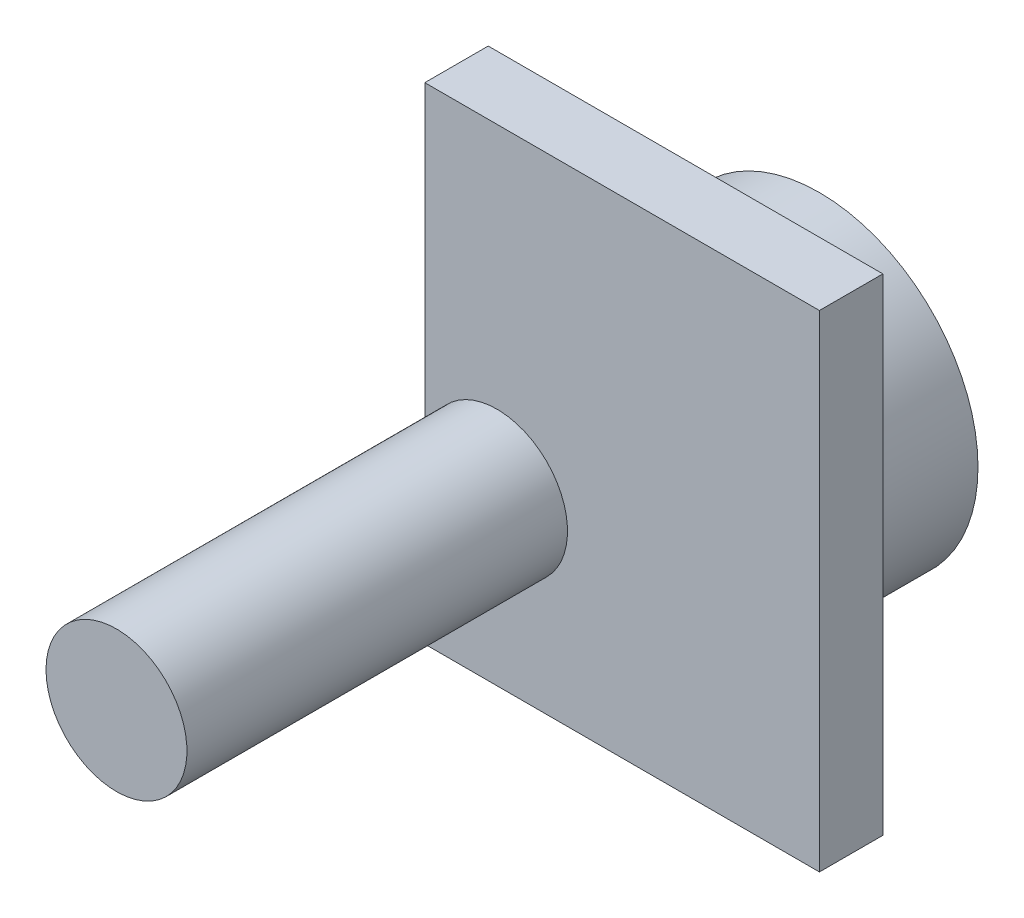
from build123d import *

# Parameters (mm, degrees)
SKETCH_1_R          = 4.5
EXTRUDE_1_DEPTH     = 4
SKETCH_2_W          = 11.2
SKETCH_2_H          = 13.8
EXTRUDE_2_DEPTH     = 1.8
CUT_EXTRUDE_1_DEPTH = 1
BLACK_DEPTH         = 1
SKETCH_4_R          = 2
EXTRUDE_3_DEPTH     = 10.8


with BuildPart() as part:
    # Sketch 1 → Extrude 1 (new body)
    with BuildSketch(Plane.XY):
        Circle(SKETCH_1_R)
    extrude(amount=EXTRUDE_1_DEPTH)

    # Sketch 2 → Extrude 2 (add)
    with BuildSketch(Plane.XY.offset(4)):
        with Locations((0.2, 0.5)):
            Rectangle(SKETCH_2_W, SKETCH_2_H)
    extrude(amount=EXTRUDE_2_DEPTH)

    # Sketch 3 → Cut-Extrude 1 (cut)
    with BuildSketch(Plane(origin=(0, 0, 0), x_dir=(-1, 0, 0), z_dir=(0, 0, -1))):
        Polygon((-3, -1.73), (3, -1.73), (0, 3.466152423), align=None)
    extrude(amount=-CUT_EXTRUDE_1_DEPTH, mode=Mode.SUBTRACT)

    # Sketch 4 → Extrude 3 (add)
    with BuildSketch(Plane.XY.offset(5.8)):
        with Locations(Location((-3.35, -1.6, 0), (0, 0, 180))):
            Circle(SKETCH_4_R)
    extrude(amount=EXTRUDE_3_DEPTH)


with BuildPart() as body_2:
    # Sketch 5 → black (new body)
    with BuildSketch(Plane(origin=(0, 0, 1), x_dir=(-1, 0, 0), z_dir=(0, 0, -1))):
        Polygon((0, 3.466152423), (-3, -1.73), (3, -1.73), align=None)
    extrude(amount=BLACK_DEPTH)


solid = Compound([part.part, body_2.part])
